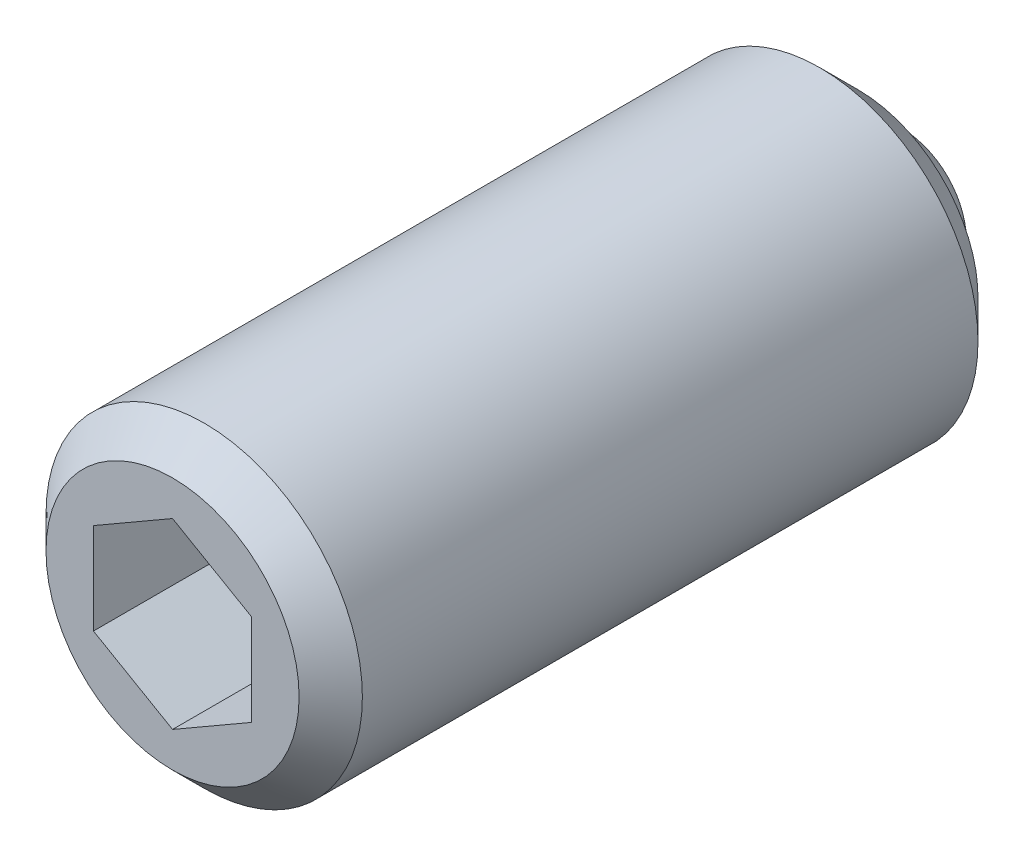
ISO-10303-21;
HEADER;
FILE_DESCRIPTION(('STEP AP214'),'2;1');
FILE_NAME('part.step','',(''),(''),'','','');
FILE_SCHEMA(('AUTOMOTIVE_DESIGN { 1 0 10303 214 1 1 1 1 }'));
ENDSEC;
DATA;
#1=APPLICATION_CONTEXT('core data for automotive mechanical design processes');
#2=APPLICATION_PROTOCOL_DEFINITION('international standard','automotive_design',2000,#1);
#3=PRODUCT_CONTEXT('',#1,'mechanical');
#4=PRODUCT('Part','Part','',(#3));
#5=PRODUCT_RELATED_PRODUCT_CATEGORY('part','',(#4));
#6=PRODUCT_DEFINITION_FORMATION('','',#4);
#7=PRODUCT_DEFINITION_CONTEXT('part definition',#1,'design');
#8=PRODUCT_DEFINITION('design','',#6,#7);
#9=PRODUCT_DEFINITION_SHAPE('','',#8);
#10=(LENGTH_UNIT() NAMED_UNIT(*) SI_UNIT(.MILLI.,.METRE.));
#11=(NAMED_UNIT(*) PLANE_ANGLE_UNIT() SI_UNIT($,.RADIAN.));
#12=(NAMED_UNIT(*) SI_UNIT($,.STERADIAN.) SOLID_ANGLE_UNIT());
#13=UNCERTAINTY_MEASURE_WITH_UNIT(LENGTH_MEASURE(1.E-05),#10,'distance_accuracy_value','');
#14=(GEOMETRIC_REPRESENTATION_CONTEXT(3) GLOBAL_UNCERTAINTY_ASSIGNED_CONTEXT((#13)) GLOBAL_UNIT_ASSIGNED_CONTEXT((#10,
#11,#12)) REPRESENTATION_CONTEXT('',''));
#15=CARTESIAN_POINT('',(0.,0.,0.));
#16=DIRECTION('',(0.,0.,1.));
#17=DIRECTION('',(1.,0.,0.));
#18=AXIS2_PLACEMENT_3D('',#15,#16,#17);
#19=CARTESIAN_POINT('',(2.99999999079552,-3.50567078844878,23.5000000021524));
#20=DIRECTION('',(3.91680004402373E-10,-2.78775266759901E-10,-1.));
#21=DIRECTION('',(-1.,0.,-3.91680004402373E-10));
#22=AXIS2_PLACEMENT_3D('',#19,#20,#21);
#23=PLANE('',#22);
#24=DIRECTION('',(-0.866025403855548,-0.499999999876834,-1.99817200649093E-10));
#25=VECTOR('',#24,1.);
#26=CARTESIAN_POINT('',(-1.50000000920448,2.59807625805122,23.4999999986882));
#27=LINE('',#26,#25);
#28=CARTESIAN_POINT('',(-1.00510644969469E-08,3.46410166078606,23.4999999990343));
#29=VERTEX_POINT('',#28);
#30=CARTESIAN_POINT('',(-3.00000000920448,1.73205085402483,23.4999999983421));
#31=VERTEX_POINT('',#30);
#32=EDGE_CURVE('E95',#29,#31,#27,.T.);
#33=ORIENTED_EDGE('',*,*,#32,.T.);
#34=DIRECTION('',(0.,-1.,2.78775266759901E-10));
#35=VECTOR('',#34,1.);
#36=CARTESIAN_POINT('',(-3.00000000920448,4.65512191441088E-08,23.499999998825));
#37=LINE('',#36,#35);
#38=CARTESIAN_POINT('',(-3.00000000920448,-1.73205076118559,23.4999999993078));
#39=VERTEX_POINT('',#38);
#40=EDGE_CURVE('E97',#31,#39,#37,.T.);
#41=ORIENTED_EDGE('',*,*,#40,.T.);
#42=DIRECTION('',(0.866025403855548,-0.499999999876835,4.78592467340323E-10));
#43=VECTOR('',#42,1.);
#44=CARTESIAN_POINT('',(-1.50000000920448,-2.59807616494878,23.5000000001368));
#45=LINE('',#44,#43);
#46=CARTESIAN_POINT('',(-8.35789555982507E-09,-3.46410156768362,23.5000000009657));
#47=VERTEX_POINT('',#46);
#48=EDGE_CURVE('E72',#39,#47,#45,.T.);
#49=ORIENTED_EDGE('',*,*,#48,.T.);
#50=DIRECTION('',(0.866025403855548,0.499999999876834,1.99817200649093E-10));
#51=VECTOR('',#50,1.);
#52=CARTESIAN_POINT('',(1.49999999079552,-2.59807616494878,23.5000000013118));
#53=LINE('',#52,#51);
#54=CARTESIAN_POINT('',(2.99999999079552,-1.73205076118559,23.5000000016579));
#55=VERTEX_POINT('',#54);
#56=EDGE_CURVE('E71',#47,#55,#53,.T.);
#57=ORIENTED_EDGE('',*,*,#56,.T.);
#58=DIRECTION('',(0.,1.,-2.78775266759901E-10));
#59=VECTOR('',#58,1.);
#60=CARTESIAN_POINT('',(2.99999999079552,4.65512183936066E-08,23.500000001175));
#61=LINE('',#60,#59);
#62=CARTESIAN_POINT('',(2.99999999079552,1.73205085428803,23.5000000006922));
#63=VERTEX_POINT('',#62);
#64=EDGE_CURVE('E100',#55,#63,#61,.T.);
#65=ORIENTED_EDGE('',*,*,#64,.T.);
#66=DIRECTION('',(-0.866025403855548,0.499999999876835,-4.78592467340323E-10));
#67=VECTOR('',#66,1.);
#68=CARTESIAN_POINT('',(1.49999999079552,2.59807625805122,23.4999999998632));
#69=LINE('',#68,#67);
#70=EDGE_CURVE('E105',#63,#29,#69,.T.);
#71=ORIENTED_EDGE('',*,*,#70,.T.);
#72=EDGE_LOOP('',(#33,#41,#49,#57,#65,#71));
#73=FACE_BOUND('',#72,.T.);
#74=ADVANCED_FACE('F14',(#73),#23,.F.);
#75=CARTESIAN_POINT('',(-3.00000001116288,-1.73205076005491,28.4999999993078));
#76=DIRECTION('',(-1.,0.,-3.91680004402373E-10));
#77=DIRECTION('',(0.,1.,-2.78775266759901E-10));
#78=AXIS2_PLACEMENT_3D('',#75,#76,#77);
#79=PLANE('',#78);
#80=DIRECTION('',(3.91680004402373E-10,-2.78775266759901E-10,-1.));
#81=VECTOR('',#80,1.);
#82=CARTESIAN_POINT('',(-3.00000001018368,-1.73205076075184,25.9999999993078));
#83=LINE('',#82,#81);
#84=CARTESIAN_POINT('',(-3.00000000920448,-1.73205076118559,28.4999999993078));
#85=VERTEX_POINT('',#84);
#86=EDGE_CURVE('E62',#85,#39,#83,.T.);
#87=ORIENTED_EDGE('',*,*,#86,.T.);
#88=ORIENTED_EDGE('',*,*,#40,.F.);
#89=DIRECTION('',(-3.91680004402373E-10,2.78775266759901E-10,1.));
#90=VECTOR('',#89,1.);
#91=CARTESIAN_POINT('',(-3.00000001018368,1.73205085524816,25.9999999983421));
#92=LINE('',#91,#90);
#93=CARTESIAN_POINT('',(-3.00000000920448,1.73205085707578,28.4999999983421));
#94=VERTEX_POINT('',#93);
#95=EDGE_CURVE('E93',#31,#94,#92,.T.);
#96=ORIENTED_EDGE('',*,*,#95,.T.);
#97=DIRECTION('',(0.,-1.,2.78775266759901E-10));
#98=VECTOR('',#97,1.);
#99=CARTESIAN_POINT('',(-3.00000000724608,4.79450954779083E-08,28.499999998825));
#100=LINE('',#99,#98);
#101=EDGE_CURVE('E50',#94,#85,#100,.T.);
#102=ORIENTED_EDGE('',*,*,#101,.T.);
#103=EDGE_LOOP('',(#87,#88,#96,#102));
#104=FACE_BOUND('',#103,.T.);
#105=ADVANCED_FACE('F125',(#104),#79,.F.);
#106=CARTESIAN_POINT('',(-1.11628805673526E-08,-3.46410156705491,28.5000000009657));
#107=DIRECTION('',(-0.499999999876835,-0.866025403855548,4.55864608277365E-11));
#108=DIRECTION('',(-0.866025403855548,0.499999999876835,-4.78592467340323E-10));
#109=AXIS2_PLACEMENT_3D('',#106,#107,#108);
#110=PLANE('',#109);
#111=DIRECTION('',(3.91680004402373E-10,-2.78775266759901E-10,-1.));
#112=VECTOR('',#111,1.);
#113=CARTESIAN_POINT('',(-1.01836805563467E-08,-3.46410156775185,26.0000000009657));
#114=LINE('',#113,#112);
#115=CARTESIAN_POINT('',(-1.11628805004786E-08,-3.46410156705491,28.5000000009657));
#116=VERTEX_POINT('',#115);
#117=EDGE_CURVE('E60',#116,#47,#114,.T.);
#118=ORIENTED_EDGE('',*,*,#117,.T.);
#119=ORIENTED_EDGE('',*,*,#48,.F.);
#120=ORIENTED_EDGE('',*,*,#86,.F.);
#121=DIRECTION('',(-0.866025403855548,0.499999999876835,-4.78592467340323E-10));
#122=VECTOR('',#121,1.);
#123=CARTESIAN_POINT('',(-1.11628805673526E-08,-3.46410156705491,28.5000000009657));
#124=LINE('',#123,#122);
#125=EDGE_CURVE('E18',#85,#116,#124,.F.);
#126=ORIENTED_EDGE('',*,*,#125,.T.);
#127=EDGE_LOOP('',(#118,#119,#120,#126));
#128=FACE_BOUND('',#127,.T.);
#129=ADVANCED_FACE('F57',(#128),#110,.F.);
#130=CARTESIAN_POINT('',(2.99999998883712,-1.73205076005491,28.5000000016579));
#131=DIRECTION('',(0.499999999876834,-0.866025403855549,4.37266465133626E-10));
#132=DIRECTION('',(-0.866025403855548,-0.499999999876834,-1.99817200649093E-10));
#133=AXIS2_PLACEMENT_3D('',#130,#131,#132);
#134=PLANE('',#133);
#135=DIRECTION('',(3.91680004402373E-10,-2.78775266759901E-10,-1.));
#136=VECTOR('',#135,1.);
#137=CARTESIAN_POINT('',(2.99999998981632,-1.73205076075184,26.0000000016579));
#138=LINE('',#137,#136);
#139=CARTESIAN_POINT('',(2.99999998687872,-1.73205076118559,28.5000000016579));
#140=VERTEX_POINT('',#139);
#141=EDGE_CURVE('E99',#140,#55,#138,.T.);
#142=ORIENTED_EDGE('',*,*,#141,.T.);
#143=ORIENTED_EDGE('',*,*,#56,.F.);
#144=ORIENTED_EDGE('',*,*,#117,.F.);
#145=DIRECTION('',(-0.866025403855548,-0.499999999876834,-1.99817200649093E-10));
#146=VECTOR('',#145,1.);
#147=CARTESIAN_POINT('',(2.99999998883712,-1.73205076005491,28.5000000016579));
#148=LINE('',#147,#146);
#149=EDGE_CURVE('E65',#116,#140,#148,.F.);
#150=ORIENTED_EDGE('',*,*,#149,.T.);
#151=EDGE_LOOP('',(#142,#143,#144,#150));
#152=FACE_BOUND('',#151,.T.);
#153=ADVANCED_FACE('F68',(#152),#134,.F.);
#154=CARTESIAN_POINT('',(2.99999998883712,1.73205085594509,28.5000000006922));
#155=DIRECTION('',(1.,0.,3.91680004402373E-10));
#156=DIRECTION('',(0.,-1.,2.78775266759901E-10));
#157=AXIS2_PLACEMENT_3D('',#154,#155,#156);
#158=PLANE('',#157);
#159=DIRECTION('',(3.91680004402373E-10,-2.78775266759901E-10,-1.));
#160=VECTOR('',#159,1.);
#161=CARTESIAN_POINT('',(2.99999998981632,1.73205085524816,26.0000000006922));
#162=LINE('',#161,#160);
#163=CARTESIAN_POINT('',(2.99999998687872,1.73205085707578,28.5000000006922));
#164=VERTEX_POINT('',#163);
#165=EDGE_CURVE('E106',#164,#63,#162,.T.);
#166=ORIENTED_EDGE('',*,*,#165,.T.);
#167=ORIENTED_EDGE('',*,*,#64,.F.);
#168=ORIENTED_EDGE('',*,*,#141,.F.);
#169=DIRECTION('',(0.,1.,-2.78775266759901E-10));
#170=VECTOR('',#169,1.);
#171=CARTESIAN_POINT('',(2.99999998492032,4.79450947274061E-08,28.500000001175));
#172=LINE('',#171,#170);
#173=EDGE_CURVE('E78',#140,#164,#172,.T.);
#174=ORIENTED_EDGE('',*,*,#173,.T.);
#175=EDGE_LOOP('',(#166,#167,#168,#174));
#176=FACE_BOUND('',#175,.T.);
#177=ADVANCED_FACE('F133',(#176),#158,.F.);
#178=CARTESIAN_POINT('',(-1.11628796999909E-08,3.4641016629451,28.4999999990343));
#179=DIRECTION('',(0.499999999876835,0.866025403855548,-4.55864608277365E-11));
#180=DIRECTION('',(0.866025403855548,-0.499999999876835,4.78592467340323E-10));
#181=AXIS2_PLACEMENT_3D('',#178,#179,#180);
#182=PLANE('',#181);
#183=DIRECTION('',(3.91680004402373E-10,-2.78775266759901E-10,-1.));
#184=VECTOR('',#183,1.);
#185=CARTESIAN_POINT('',(-1.01836796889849E-08,3.46410166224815,25.9999999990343));
#186=LINE('',#185,#184);
#187=CARTESIAN_POINT('',(-1.11628797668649E-08,3.4641016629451,28.4999999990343));
#188=VERTEX_POINT('',#187);
#189=EDGE_CURVE('E102',#188,#29,#186,.T.);
#190=ORIENTED_EDGE('',*,*,#189,.T.);
#191=ORIENTED_EDGE('',*,*,#70,.F.);
#192=ORIENTED_EDGE('',*,*,#165,.F.);
#193=DIRECTION('',(0.866025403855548,-0.499999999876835,4.78592467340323E-10));
#194=VECTOR('',#193,1.);
#195=CARTESIAN_POINT('',(-1.11628796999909E-08,3.4641016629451,28.4999999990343));
#196=LINE('',#195,#194);
#197=EDGE_CURVE('E79',#164,#188,#196,.F.);
#198=ORIENTED_EDGE('',*,*,#197,.T.);
#199=EDGE_LOOP('',(#190,#191,#192,#198));
#200=FACE_BOUND('',#199,.T.);
#201=ADVANCED_FACE('F136',(#200),#182,.F.);
#202=CARTESIAN_POINT('',(-3.00000001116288,1.73205085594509,28.4999999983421));
#203=DIRECTION('',(-0.499999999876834,0.866025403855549,-4.37266465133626E-10));
#204=DIRECTION('',(0.866025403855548,0.499999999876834,1.99817200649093E-10));
#205=AXIS2_PLACEMENT_3D('',#202,#203,#204);
#206=PLANE('',#205);
#207=ORIENTED_EDGE('',*,*,#95,.F.);
#208=ORIENTED_EDGE('',*,*,#32,.F.);
#209=ORIENTED_EDGE('',*,*,#189,.F.);
#210=DIRECTION('',(0.866025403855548,0.499999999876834,1.99817200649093E-10));
#211=VECTOR('',#210,1.);
#212=CARTESIAN_POINT('',(-3.00000001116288,1.73205085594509,28.4999999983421));
#213=LINE('',#212,#211);
#214=EDGE_CURVE('E83',#188,#94,#213,.F.);
#215=ORIENTED_EDGE('',*,*,#214,.T.);
#216=EDGE_LOOP('',(#207,#208,#209,#215));
#217=FACE_BOUND('',#216,.T.);
#218=ADVANCED_FACE('F140',(#217),#206,.F.);
#219=CARTESIAN_POINT('',(4.85759998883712,-4.87431480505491,28.5000000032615));
#220=DIRECTION('',(3.91680004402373E-10,-2.78775266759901E-10,-1.));
#221=DIRECTION('',(-1.,0.,-3.91680004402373E-10));
#222=AXIS2_PLACEMENT_3D('',#219,#220,#221);
#223=PLANE('',#222);
#224=ORIENTED_EDGE('',*,*,#197,.F.);
#225=ORIENTED_EDGE('',*,*,#173,.F.);
#226=ORIENTED_EDGE('',*,*,#149,.F.);
#227=ORIENTED_EDGE('',*,*,#125,.F.);
#228=ORIENTED_EDGE('',*,*,#101,.F.);
#229=ORIENTED_EDGE('',*,*,#214,.F.);
#230=EDGE_LOOP('',(#224,#225,#226,#227,#228,#229));
#231=FACE_BOUND('',#230,.T.);
#232=CARTESIAN_POINT('',(-1.11628801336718E-08,4.79450951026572E-08,28.5));
#233=DIRECTION('',(3.91680004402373E-10,-2.78775266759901E-10,-1.));
#234=DIRECTION('',(-1.,0.,-3.91680004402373E-10));
#235=AXIS2_PLACEMENT_3D('',#232,#233,#234);
#236=CIRCLE('',#235,4.8);
#237=CARTESIAN_POINT('',(-4.80000001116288,4.79450957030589E-08,28.4999999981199));
#238=VERTEX_POINT('',#237);
#239=EDGE_CURVE('E86',#238,#238,#236,.T.);
#240=ORIENTED_EDGE('',*,*,#239,.F.);
#241=EDGE_LOOP('',(#240));
#242=FACE_BOUND('',#241,.T.);
#243=ADVANCED_FACE('F76',(#231,#242),#223,.F.);
#244=CARTESIAN_POINT('',(-1.11628801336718E-08,4.79450951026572E-08,28.5));
#245=DIRECTION('',(3.91680004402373E-10,-2.78775266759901E-10,-1.));
#246=DIRECTION('',(-1.,0.,-3.91680004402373E-10));
#247=AXIS2_PLACEMENT_3D('',#244,#245,#246);
#248=CONICAL_SURFACE('',#247,4.8,0.785398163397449);
#249=CARTESIAN_POINT('',(-1.06928641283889E-08,4.76105647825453E-08,27.3));
#250=DIRECTION('',(-3.91680004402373E-10,2.78775266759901E-10,1.));
#251=DIRECTION('',(1.,0.,3.91680004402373E-10));
#252=AXIS2_PLACEMENT_3D('',#249,#250,#251);
#253=CIRCLE('',#252,6.);
#254=CARTESIAN_POINT('',(5.99999998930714,4.76105640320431E-08,27.3000000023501));
#255=VERTEX_POINT('',#254);
#256=EDGE_CURVE('E89',#255,#255,#253,.F.);
#257=ORIENTED_EDGE('',*,*,#256,.F.);
#258=EDGE_LOOP('',(#257));
#259=FACE_BOUND('',#258,.T.);
#260=ORIENTED_EDGE('',*,*,#239,.T.);
#261=EDGE_LOOP('',(#260));
#262=FACE_BOUND('',#261,.T.);
#263=ADVANCED_FACE('F145',(#259,#262),#248,.T.);
#264=CARTESIAN_POINT('',(-1.5471360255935E-09,4.11011623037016E-08,3.95));
#265=DIRECTION('',(-3.91680004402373E-10,2.78775266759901E-10,1.));
#266=DIRECTION('',(1.,0.,3.91680004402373E-10));
#267=AXIS2_PLACEMENT_3D('',#264,#265,#266);
#268=CYLINDRICAL_SURFACE('',#267,6.);
#269=ORIENTED_EDGE('',*,*,#256,.T.);
#270=EDGE_LOOP('',(#269));
#271=FACE_BOUND('',#270,.T.);
#272=CARTESIAN_POINT('',(-1.5471360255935E-09,4.11011623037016E-08,3.95));
#273=DIRECTION('',(-3.91680004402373E-10,2.78775266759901E-10,1.));
#274=DIRECTION('',(1.,0.,3.91680004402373E-10));
#275=AXIS2_PLACEMENT_3D('',#272,#273,#274);
#276=CIRCLE('',#275,6.);
#277=CARTESIAN_POINT('',(5.99999999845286,4.11011615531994E-08,3.95000000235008));
#278=VERTEX_POINT('',#277);
#279=EDGE_CURVE('E91',#278,#278,#276,.F.);
#280=ORIENTED_EDGE('',*,*,#279,.F.);
#281=EDGE_LOOP('',(#280));
#282=FACE_BOUND('',#281,.T.);
#283=ADVANCED_FACE('F151',(#271,#282),#268,.T.);
#284=CARTESIAN_POINT('',(-9.79200019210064E-10,4.06969381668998E-08,2.5));
#285=DIRECTION('',(-3.91680004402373E-10,2.78774885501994E-10,1.));
#286=DIRECTION('',(0.,1.,-2.78774885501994E-10));
#287=AXIS2_PLACEMENT_3D('',#284,#285,#286);
#288=CONICAL_SURFACE('',#287,4.55,0.785398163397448);
#289=ORIENTED_EDGE('',*,*,#279,.T.);
#290=EDGE_LOOP('',(#289));
#291=FACE_BOUND('',#290,.T.);
#292=CARTESIAN_POINT('',(-9.79200019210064E-10,4.06969381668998E-08,2.5));
#293=DIRECTION('',(-3.91680004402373E-10,2.78774885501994E-10,1.));
#294=DIRECTION('',(0.,1.,-2.78774885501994E-10));
#295=AXIS2_PLACEMENT_3D('',#292,#293,#294);
#296=CIRCLE('',#295,4.55);
#297=CARTESIAN_POINT('',(-9.79199449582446E-10,4.55000004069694,2.49999999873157));
#298=VERTEX_POINT('',#297);
#299=EDGE_CURVE('E24',#298,#298,#296,.T.);
#300=ORIENTED_EDGE('',*,*,#299,.T.);
#301=EDGE_LOOP('',(#300));
#302=FACE_BOUND('',#301,.T.);
#303=ADVANCED_FACE('F121',(#291,#302),#288,.T.);
#304=CARTESIAN_POINT('',(-4.6046000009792,-4.62044424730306,2.49999999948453));
#305=DIRECTION('',(-3.91680004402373E-10,2.78775266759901E-10,1.));
#306=DIRECTION('',(1.,0.,3.91680004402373E-10));
#307=AXIS2_PLACEMENT_3D('',#304,#305,#306);
#308=PLANE('',#307);
#309=CARTESIAN_POINT('',(-9.79200019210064E-10,4.06969381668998E-08,2.5));
#310=DIRECTION('',(-3.91680004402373E-10,2.78775266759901E-10,1.));
#311=DIRECTION('',(1.,0.,3.91680004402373E-10));
#312=AXIS2_PLACEMENT_3D('',#309,#310,#311);
#313=CIRCLE('',#312,3.70809924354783);
#314=CARTESIAN_POINT('',(3.70809924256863,4.0696937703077E-08,2.50000000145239));
#315=VERTEX_POINT('',#314);
#316=EDGE_CURVE('E9',#315,#315,#313,.F.);
#317=ORIENTED_EDGE('',*,*,#316,.F.);
#318=EDGE_LOOP('',(#317));
#319=FACE_BOUND('',#318,.T.);
#320=ORIENTED_EDGE('',*,*,#299,.F.);
#321=EDGE_LOOP('',(#320));
#322=FACE_BOUND('',#321,.T.);
#323=ADVANCED_FACE('F16',(#319,#322),#308,.F.);
#324=CARTESIAN_POINT('',(-1.56672002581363E-09,4.11151010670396E-08,4.));
#325=DIRECTION('',(-3.91680004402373E-10,2.78775266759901E-10,1.));
#326=DIRECTION('',(0.,1.,-2.78775266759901E-10));
#327=AXIS2_PLACEMENT_3D('',#324,#325,#326);
#328=SPHERICAL_SURFACE('',#327,4.);
#329=CARTESIAN_POINT('',(0.,0.,0.));
#330=VERTEX_POINT('',#329);
#331=VERTEX_LOOP('',#330);
#332=FACE_BOUND('',#331,.T.);
#333=ORIENTED_EDGE('',*,*,#316,.T.);
#334=EDGE_LOOP('',(#333));
#335=FACE_BOUND('',#334,.T.);
#336=ADVANCED_FACE('F117',(#332,#335),#328,.T.);
#337=CLOSED_SHELL('',(#74,#105,#129,#153,#177,#201,#218,#243,#263,#283,#303,#323,#336));
#338=MANIFOLD_SOLID_BREP('B1',#337);
#339=ADVANCED_BREP_SHAPE_REPRESENTATION('',(#18,#338),#14);
#340=SHAPE_DEFINITION_REPRESENTATION(#9,#339);
ENDSEC;
END-ISO-10303-21;
